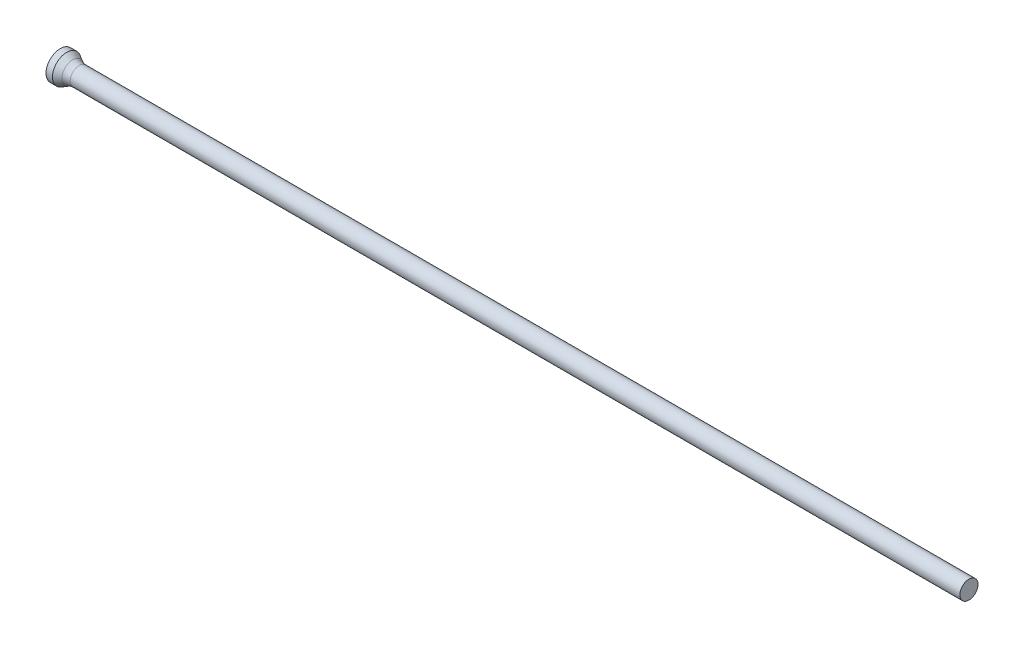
ISO-10303-21;
HEADER;
FILE_DESCRIPTION(('STEP AP214'),'2;1');
FILE_NAME('part.step','',(''),(''),'','','');
FILE_SCHEMA(('AUTOMOTIVE_DESIGN { 1 0 10303 214 1 1 1 1 }'));
ENDSEC;
DATA;
#1=APPLICATION_CONTEXT('core data for automotive mechanical design processes');
#2=APPLICATION_PROTOCOL_DEFINITION('international standard','automotive_design',2000,#1);
#3=PRODUCT_CONTEXT('',#1,'mechanical');
#4=PRODUCT('Part','Part','',(#3));
#5=PRODUCT_RELATED_PRODUCT_CATEGORY('part','',(#4));
#6=PRODUCT_DEFINITION_FORMATION('','',#4);
#7=PRODUCT_DEFINITION_CONTEXT('part definition',#1,'design');
#8=PRODUCT_DEFINITION('design','',#6,#7);
#9=PRODUCT_DEFINITION_SHAPE('','',#8);
#10=(LENGTH_UNIT() NAMED_UNIT(*) SI_UNIT(.MILLI.,.METRE.));
#11=(NAMED_UNIT(*) PLANE_ANGLE_UNIT() SI_UNIT($,.RADIAN.));
#12=(NAMED_UNIT(*) SI_UNIT($,.STERADIAN.) SOLID_ANGLE_UNIT());
#13=UNCERTAINTY_MEASURE_WITH_UNIT(LENGTH_MEASURE(1.E-05),#10,'distance_accuracy_value','');
#14=(GEOMETRIC_REPRESENTATION_CONTEXT(3) GLOBAL_UNCERTAINTY_ASSIGNED_CONTEXT((#13)) GLOBAL_UNIT_ASSIGNED_CONTEXT((#10,
#11,#12)) REPRESENTATION_CONTEXT('',''));
#15=CARTESIAN_POINT('',(0.,0.,0.));
#16=DIRECTION('',(0.,0.,1.));
#17=DIRECTION('',(1.,0.,0.));
#18=AXIS2_PLACEMENT_3D('',#15,#16,#17);
#19=CARTESIAN_POINT('',(0.,0.,0.));
#20=DIRECTION('',(1.,0.,0.));
#21=DIRECTION('',(0.,0.,-1.));
#22=AXIS2_PLACEMENT_3D('',#19,#20,#21);
#23=PLANE('',#22);
#24=CARTESIAN_POINT('',(0.,0.,0.));
#25=DIRECTION('',(-1.,0.,0.));
#26=DIRECTION('',(0.,0.,1.));
#27=AXIS2_PLACEMENT_3D('',#24,#25,#26);
#28=CIRCLE('',#27,1.1);
#29=CARTESIAN_POINT('',(0.,0.,1.1));
#30=VERTEX_POINT('',#29);
#31=EDGE_CURVE('E25',#30,#30,#28,.T.);
#32=ORIENTED_EDGE('',*,*,#31,.T.);
#33=EDGE_LOOP('',(#32));
#34=FACE_BOUND('',#33,.T.);
#35=ADVANCED_FACE('F14',(#34),#23,.F.);
#36=CARTESIAN_POINT('',(0.,0.,0.));
#37=DIRECTION('',(-1.,0.,0.));
#38=DIRECTION('',(0.,0.,1.));
#39=AXIS2_PLACEMENT_3D('',#36,#37,#38);
#40=CYLINDRICAL_SURFACE('',#39,1.1);
#41=ORIENTED_EDGE('',*,*,#31,.F.);
#42=EDGE_LOOP('',(#41));
#43=FACE_BOUND('',#42,.T.);
#44=CARTESIAN_POINT('',(0.497179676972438,0.,0.));
#45=DIRECTION('',(-1.,0.,0.));
#46=DIRECTION('',(0.,0.,1.));
#47=AXIS2_PLACEMENT_3D('',#44,#45,#46);
#48=CIRCLE('',#47,1.1);
#49=CARTESIAN_POINT('',(0.497179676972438,0.,1.1));
#50=VERTEX_POINT('',#49);
#51=EDGE_CURVE('E29',#50,#50,#48,.T.);
#52=ORIENTED_EDGE('',*,*,#51,.T.);
#53=EDGE_LOOP('',(#52));
#54=FACE_BOUND('',#53,.T.);
#55=ADVANCED_FACE('F53',(#43,#54),#40,.T.);
#56=CARTESIAN_POINT('',(1.19,0.,0.));
#57=DIRECTION('',(-1.,0.,0.));
#58=DIRECTION('',(0.,0.,1.));
#59=AXIS2_PLACEMENT_3D('',#56,#57,#58);
#60=CONICAL_SURFACE('',#59,0.7,0.523598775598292);
#61=CARTESIAN_POINT('',(0.957949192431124,0.,0.));
#62=DIRECTION('',(-1.,0.,0.));
#63=DIRECTION('',(0.,0.,1.));
#64=AXIS2_PLACEMENT_3D('',#61,#62,#63);
#65=CIRCLE('',#64,0.833974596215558);
#66=CARTESIAN_POINT('',(0.957949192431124,0.,0.833974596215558));
#67=VERTEX_POINT('',#66);
#68=EDGE_CURVE('E21',#67,#67,#65,.T.);
#69=ORIENTED_EDGE('',*,*,#68,.T.);
#70=EDGE_LOOP('',(#69));
#71=FACE_BOUND('',#70,.T.);
#72=ORIENTED_EDGE('',*,*,#51,.F.);
#73=EDGE_LOOP('',(#72));
#74=FACE_BOUND('',#73,.T.);
#75=ADVANCED_FACE('F50',(#71,#74),#60,.T.);
#76=CARTESIAN_POINT('',(0.,0.,0.));
#77=DIRECTION('',(-1.,0.,0.));
#78=DIRECTION('',(0.,0.,1.));
#79=AXIS2_PLACEMENT_3D('',#76,#77,#78);
#80=CYLINDRICAL_SURFACE('',#79,0.7);
#81=CARTESIAN_POINT('',(1.45794919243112,0.,0.));
#82=DIRECTION('',(-1.,0.,0.));
#83=DIRECTION('',(0.,0.,1.));
#84=AXIS2_PLACEMENT_3D('',#81,#82,#83);
#85=CIRCLE('',#84,0.7);
#86=CARTESIAN_POINT('',(1.45794919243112,0.,0.7));
#87=VERTEX_POINT('',#86);
#88=EDGE_CURVE('E9',#87,#87,#85,.F.);
#89=ORIENTED_EDGE('',*,*,#88,.T.);
#90=EDGE_LOOP('',(#89));
#91=FACE_BOUND('',#90,.T.);
#92=CARTESIAN_POINT('',(70.,0.,0.));
#93=DIRECTION('',(-1.,0.,0.));
#94=DIRECTION('',(0.,0.,1.));
#95=AXIS2_PLACEMENT_3D('',#92,#93,#94);
#96=CIRCLE('',#95,0.7);
#97=CARTESIAN_POINT('',(70.,0.,0.7));
#98=VERTEX_POINT('',#97);
#99=EDGE_CURVE('E34',#98,#98,#96,.T.);
#100=ORIENTED_EDGE('',*,*,#99,.T.);
#101=EDGE_LOOP('',(#100));
#102=FACE_BOUND('',#101,.T.);
#103=ADVANCED_FACE('F38',(#91,#102),#80,.T.);
#104=CARTESIAN_POINT('',(70.,0.7,0.));
#105=DIRECTION('',(-1.,0.,0.));
#106=DIRECTION('',(0.,0.,1.));
#107=AXIS2_PLACEMENT_3D('',#104,#105,#106);
#108=PLANE('',#107);
#109=ORIENTED_EDGE('',*,*,#99,.F.);
#110=EDGE_LOOP('',(#109));
#111=FACE_BOUND('',#110,.T.);
#112=ADVANCED_FACE('F40',(#111),#108,.F.);
#113=CARTESIAN_POINT('',(1.45794919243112,0.,0.));
#114=DIRECTION('',(-1.,0.,0.));
#115=DIRECTION('',(0.,0.,1.));
#116=AXIS2_PLACEMENT_3D('',#113,#114,#115);
#117=TOROIDAL_SURFACE('',#116,1.7,1.);
#118=ORIENTED_EDGE('',*,*,#88,.F.);
#119=EDGE_LOOP('',(#118));
#120=FACE_BOUND('',#119,.T.);
#121=ORIENTED_EDGE('',*,*,#68,.F.);
#122=EDGE_LOOP('',(#121));
#123=FACE_BOUND('',#122,.T.);
#124=ADVANCED_FACE('F16',(#120,#123),#117,.F.);
#125=CLOSED_SHELL('',(#35,#55,#75,#103,#112,#124));
#126=MANIFOLD_SOLID_BREP('B1',#125);
#127=ADVANCED_BREP_SHAPE_REPRESENTATION('',(#18,#126),#14);
#128=SHAPE_DEFINITION_REPRESENTATION(#9,#127);
ENDSEC;
END-ISO-10303-21;
